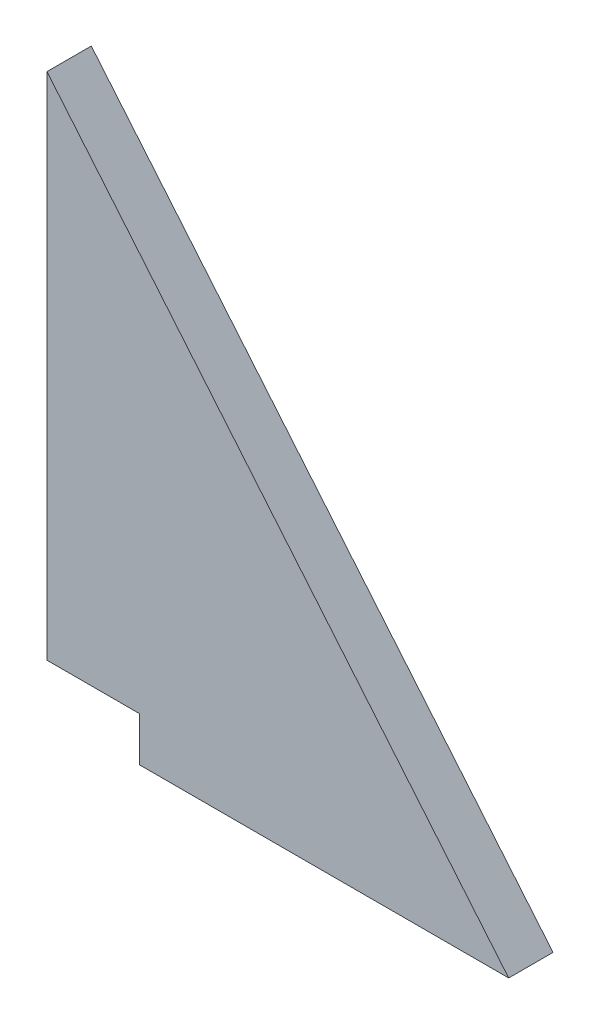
ISO-10303-21;
HEADER;
FILE_DESCRIPTION(('STEP AP214'),'2;1');
FILE_NAME('part.step','',(''),(''),'','','');
FILE_SCHEMA(('AUTOMOTIVE_DESIGN { 1 0 10303 214 1 1 1 1 }'));
ENDSEC;
DATA;
#1=APPLICATION_CONTEXT('core data for automotive mechanical design processes');
#2=APPLICATION_PROTOCOL_DEFINITION('international standard','automotive_design',2000,#1);
#3=PRODUCT_CONTEXT('',#1,'mechanical');
#4=PRODUCT('Part','Part','',(#3));
#5=PRODUCT_RELATED_PRODUCT_CATEGORY('part','',(#4));
#6=PRODUCT_DEFINITION_FORMATION('','',#4);
#7=PRODUCT_DEFINITION_CONTEXT('part definition',#1,'design');
#8=PRODUCT_DEFINITION('design','',#6,#7);
#9=PRODUCT_DEFINITION_SHAPE('','',#8);
#10=(LENGTH_UNIT() NAMED_UNIT(*) SI_UNIT(.MILLI.,.METRE.));
#11=(NAMED_UNIT(*) PLANE_ANGLE_UNIT() SI_UNIT($,.RADIAN.));
#12=(NAMED_UNIT(*) SI_UNIT($,.STERADIAN.) SOLID_ANGLE_UNIT());
#13=UNCERTAINTY_MEASURE_WITH_UNIT(LENGTH_MEASURE(1.E-05),#10,'distance_accuracy_value','');
#14=(GEOMETRIC_REPRESENTATION_CONTEXT(3) GLOBAL_UNCERTAINTY_ASSIGNED_CONTEXT((#13)) GLOBAL_UNIT_ASSIGNED_CONTEXT((#10,
#11,#12)) REPRESENTATION_CONTEXT('',''));
#15=CARTESIAN_POINT('',(0.,0.,0.));
#16=DIRECTION('',(0.,0.,1.));
#17=DIRECTION('',(1.,0.,0.));
#18=AXIS2_PLACEMENT_3D('',#15,#16,#17);
#19=CARTESIAN_POINT('',(43.202010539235,55.702010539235,12.));
#20=DIRECTION('',(0.,0.,1.));
#21=DIRECTION('',(1.,0.,0.));
#22=AXIS2_PLACEMENT_3D('',#19,#20,#21);
#23=PLANE('',#22);
#24=DIRECTION('',(1.,0.,0.));
#25=VECTOR('',#24,1.);
#26=CARTESIAN_POINT('',(0.,12.,12.));
#27=LINE('',#26,#25);
#28=CARTESIAN_POINT('',(0.,12.,12.));
#29=VERTEX_POINT('',#28);
#30=CARTESIAN_POINT('',(25.,12.,12.));
#31=VERTEX_POINT('',#30);
#32=EDGE_CURVE('E88',#29,#31,#27,.T.);
#33=ORIENTED_EDGE('',*,*,#32,.T.);
#34=DIRECTION('',(0.,-1.,0.));
#35=VECTOR('',#34,1.);
#36=CARTESIAN_POINT('',(25.,12.,12.));
#37=LINE('',#36,#35);
#38=CARTESIAN_POINT('',(25.,0.,12.));
#39=VERTEX_POINT('',#38);
#40=EDGE_CURVE('E117',#31,#39,#37,.T.);
#41=ORIENTED_EDGE('',*,*,#40,.T.);
#42=DIRECTION('',(1.,0.,0.));
#43=VECTOR('',#42,1.);
#44=CARTESIAN_POINT('',(25.,0.,12.));
#45=LINE('',#44,#43);
#46=CARTESIAN_POINT('',(125.,0.,12.));
#47=VERTEX_POINT('',#46);
#48=EDGE_CURVE('E108',#39,#47,#45,.T.);
#49=ORIENTED_EDGE('',*,*,#48,.T.);
#50=DIRECTION('',(-0.640184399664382,0.768221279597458,0.));
#51=VECTOR('',#50,1.);
#52=CARTESIAN_POINT('',(125.,0.,12.));
#53=LINE('',#52,#51);
#54=CARTESIAN_POINT('',(0.,150.,12.));
#55=VERTEX_POINT('',#54);
#56=EDGE_CURVE('E80',#47,#55,#53,.T.);
#57=ORIENTED_EDGE('',*,*,#56,.T.);
#58=DIRECTION('',(0.,-1.,0.));
#59=VECTOR('',#58,1.);
#60=CARTESIAN_POINT('',(0.,150.,12.));
#61=LINE('',#60,#59);
#62=EDGE_CURVE('E10',#55,#29,#61,.T.);
#63=ORIENTED_EDGE('',*,*,#62,.T.);
#64=EDGE_LOOP('',(#33,#41,#49,#57,#63));
#65=FACE_BOUND('',#64,.T.);
#66=ADVANCED_FACE('F16',(#65),#23,.T.);
#67=CARTESIAN_POINT('',(43.202010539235,55.702010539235,0.));
#68=DIRECTION('',(0.,0.,1.));
#69=DIRECTION('',(1.,0.,0.));
#70=AXIS2_PLACEMENT_3D('',#67,#68,#69);
#71=PLANE('',#70);
#72=DIRECTION('',(0.,-1.,0.));
#73=VECTOR('',#72,1.);
#74=CARTESIAN_POINT('',(0.,150.,0.));
#75=LINE('',#74,#73);
#76=CARTESIAN_POINT('',(0.,150.,0.));
#77=VERTEX_POINT('',#76);
#78=CARTESIAN_POINT('',(0.,12.,0.));
#79=VERTEX_POINT('',#78);
#80=EDGE_CURVE('E26',#77,#79,#75,.T.);
#81=ORIENTED_EDGE('',*,*,#80,.F.);
#82=DIRECTION('',(-0.640184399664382,0.768221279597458,0.));
#83=VECTOR('',#82,1.);
#84=CARTESIAN_POINT('',(125.,0.,0.));
#85=LINE('',#84,#83);
#86=CARTESIAN_POINT('',(125.,0.,0.));
#87=VERTEX_POINT('',#86);
#88=EDGE_CURVE('E126',#87,#77,#85,.T.);
#89=ORIENTED_EDGE('',*,*,#88,.F.);
#90=DIRECTION('',(1.,0.,0.));
#91=VECTOR('',#90,1.);
#92=CARTESIAN_POINT('',(25.,0.,0.));
#93=LINE('',#92,#91);
#94=CARTESIAN_POINT('',(25.,0.,0.));
#95=VERTEX_POINT('',#94);
#96=EDGE_CURVE('E109',#95,#87,#93,.T.);
#97=ORIENTED_EDGE('',*,*,#96,.F.);
#98=DIRECTION('',(0.,-1.,0.));
#99=VECTOR('',#98,1.);
#100=CARTESIAN_POINT('',(25.,12.,0.));
#101=LINE('',#100,#99);
#102=CARTESIAN_POINT('',(25.,12.,0.));
#103=VERTEX_POINT('',#102);
#104=EDGE_CURVE('E90',#103,#95,#101,.T.);
#105=ORIENTED_EDGE('',*,*,#104,.F.);
#106=DIRECTION('',(1.,0.,0.));
#107=VECTOR('',#106,1.);
#108=CARTESIAN_POINT('',(0.,12.,0.));
#109=LINE('',#108,#107);
#110=EDGE_CURVE('E86',#79,#103,#109,.T.);
#111=ORIENTED_EDGE('',*,*,#110,.F.);
#112=EDGE_LOOP('',(#81,#89,#97,#105,#111));
#113=FACE_BOUND('',#112,.T.);
#114=ADVANCED_FACE('F92',(#113),#71,.F.);
#115=CARTESIAN_POINT('',(0.,150.,0.));
#116=DIRECTION('',(1.,0.,0.));
#117=DIRECTION('',(0.,1.,0.));
#118=AXIS2_PLACEMENT_3D('',#115,#116,#117);
#119=PLANE('',#118);
#120=ORIENTED_EDGE('',*,*,#80,.T.);
#121=DIRECTION('',(0.,0.,1.));
#122=VECTOR('',#121,1.);
#123=CARTESIAN_POINT('',(0.,12.,0.));
#124=LINE('',#123,#122);
#125=EDGE_CURVE('E73',#79,#29,#124,.T.);
#126=ORIENTED_EDGE('',*,*,#125,.T.);
#127=ORIENTED_EDGE('',*,*,#62,.F.);
#128=DIRECTION('',(0.,0.,1.));
#129=VECTOR('',#128,1.);
#130=CARTESIAN_POINT('',(0.,150.,0.));
#131=LINE('',#130,#129);
#132=EDGE_CURVE('E19',#77,#55,#131,.T.);
#133=ORIENTED_EDGE('',*,*,#132,.F.);
#134=EDGE_LOOP('',(#120,#126,#127,#133));
#135=FACE_BOUND('',#134,.T.);
#136=ADVANCED_FACE('F72',(#135),#119,.F.);
#137=CARTESIAN_POINT('',(125.,0.,0.));
#138=DIRECTION('',(-0.768221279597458,-0.640184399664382,0.));
#139=DIRECTION('',(-0.640184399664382,0.768221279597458,0.));
#140=AXIS2_PLACEMENT_3D('',#137,#138,#139);
#141=PLANE('',#140);
#142=ORIENTED_EDGE('',*,*,#88,.T.);
#143=ORIENTED_EDGE('',*,*,#132,.T.);
#144=ORIENTED_EDGE('',*,*,#56,.F.);
#145=DIRECTION('',(0.,0.,1.));
#146=VECTOR('',#145,1.);
#147=CARTESIAN_POINT('',(125.,0.,0.));
#148=LINE('',#147,#146);
#149=EDGE_CURVE('E106',#87,#47,#148,.T.);
#150=ORIENTED_EDGE('',*,*,#149,.F.);
#151=EDGE_LOOP('',(#142,#143,#144,#150));
#152=FACE_BOUND('',#151,.T.);
#153=ADVANCED_FACE('F134',(#152),#141,.F.);
#154=CARTESIAN_POINT('',(25.,0.,0.));
#155=DIRECTION('',(0.,1.,0.));
#156=DIRECTION('',(1.,0.,0.));
#157=AXIS2_PLACEMENT_3D('',#154,#155,#156);
#158=PLANE('',#157);
#159=ORIENTED_EDGE('',*,*,#96,.T.);
#160=ORIENTED_EDGE('',*,*,#149,.T.);
#161=ORIENTED_EDGE('',*,*,#48,.F.);
#162=DIRECTION('',(0.,0.,1.));
#163=VECTOR('',#162,1.);
#164=CARTESIAN_POINT('',(25.,0.,0.));
#165=LINE('',#164,#163);
#166=EDGE_CURVE('E105',#95,#39,#165,.T.);
#167=ORIENTED_EDGE('',*,*,#166,.F.);
#168=EDGE_LOOP('',(#159,#160,#161,#167));
#169=FACE_BOUND('',#168,.T.);
#170=ADVANCED_FACE('F139',(#169),#158,.F.);
#171=CARTESIAN_POINT('',(25.,12.,0.));
#172=DIRECTION('',(1.,0.,0.));
#173=DIRECTION('',(0.,1.,0.));
#174=AXIS2_PLACEMENT_3D('',#171,#172,#173);
#175=PLANE('',#174);
#176=ORIENTED_EDGE('',*,*,#104,.T.);
#177=ORIENTED_EDGE('',*,*,#166,.T.);
#178=ORIENTED_EDGE('',*,*,#40,.F.);
#179=DIRECTION('',(0.,0.,1.));
#180=VECTOR('',#179,1.);
#181=CARTESIAN_POINT('',(25.,12.,0.));
#182=LINE('',#181,#180);
#183=EDGE_CURVE('E96',#103,#31,#182,.T.);
#184=ORIENTED_EDGE('',*,*,#183,.F.);
#185=EDGE_LOOP('',(#176,#177,#178,#184));
#186=FACE_BOUND('',#185,.T.);
#187=ADVANCED_FACE('F141',(#186),#175,.F.);
#188=CARTESIAN_POINT('',(0.,12.,0.));
#189=DIRECTION('',(0.,1.,0.));
#190=DIRECTION('',(1.,0.,0.));
#191=AXIS2_PLACEMENT_3D('',#188,#189,#190);
#192=PLANE('',#191);
#193=ORIENTED_EDGE('',*,*,#110,.T.);
#194=ORIENTED_EDGE('',*,*,#183,.T.);
#195=ORIENTED_EDGE('',*,*,#32,.F.);
#196=ORIENTED_EDGE('',*,*,#125,.F.);
#197=EDGE_LOOP('',(#193,#194,#195,#196));
#198=FACE_BOUND('',#197,.T.);
#199=ADVANCED_FACE('F84',(#198),#192,.F.);
#200=CLOSED_SHELL('',(#66,#114,#136,#153,#170,#187,#199));
#201=MANIFOLD_SOLID_BREP('B1',#200);
#202=ADVANCED_BREP_SHAPE_REPRESENTATION('',(#18,#201),#14);
#203=SHAPE_DEFINITION_REPRESENTATION(#9,#202);
ENDSEC;
END-ISO-10303-21;
